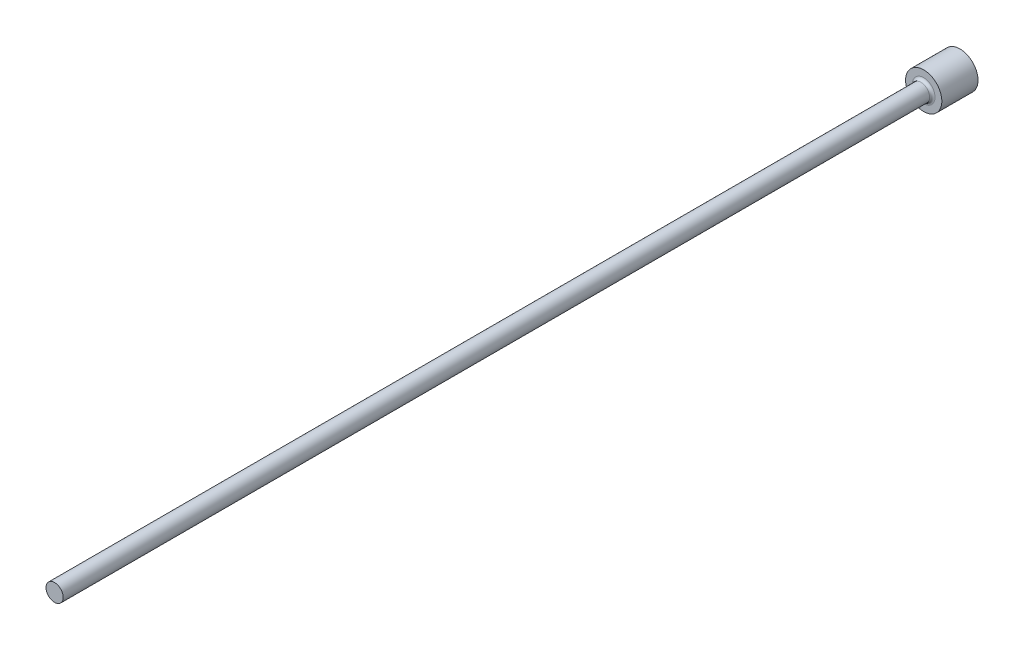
ISO-10303-21;
HEADER;
FILE_DESCRIPTION(('STEP AP214'),'2;1');
FILE_NAME('part.step','',(''),(''),'','','');
FILE_SCHEMA(('AUTOMOTIVE_DESIGN { 1 0 10303 214 1 1 1 1 }'));
ENDSEC;
DATA;
#1=APPLICATION_CONTEXT('core data for automotive mechanical design processes');
#2=APPLICATION_PROTOCOL_DEFINITION('international standard','automotive_design',2000,#1);
#3=PRODUCT_CONTEXT('',#1,'mechanical');
#4=PRODUCT('Part','Part','',(#3));
#5=PRODUCT_RELATED_PRODUCT_CATEGORY('part','',(#4));
#6=PRODUCT_DEFINITION_FORMATION('','',#4);
#7=PRODUCT_DEFINITION_CONTEXT('part definition',#1,'design');
#8=PRODUCT_DEFINITION('design','',#6,#7);
#9=PRODUCT_DEFINITION_SHAPE('','',#8);
#10=(LENGTH_UNIT() NAMED_UNIT(*) SI_UNIT(.MILLI.,.METRE.));
#11=(NAMED_UNIT(*) PLANE_ANGLE_UNIT() SI_UNIT($,.RADIAN.));
#12=(NAMED_UNIT(*) SI_UNIT($,.STERADIAN.) SOLID_ANGLE_UNIT());
#13=UNCERTAINTY_MEASURE_WITH_UNIT(LENGTH_MEASURE(1.E-05),#10,'distance_accuracy_value','');
#14=(GEOMETRIC_REPRESENTATION_CONTEXT(3) GLOBAL_UNCERTAINTY_ASSIGNED_CONTEXT((#13)) GLOBAL_UNIT_ASSIGNED_CONTEXT((#10,
#11,#12)) REPRESENTATION_CONTEXT('',''));
#15=CARTESIAN_POINT('',(0.,0.,0.));
#16=DIRECTION('',(0.,0.,1.));
#17=DIRECTION('',(1.,0.,0.));
#18=AXIS2_PLACEMENT_3D('',#15,#16,#17);
#19=CARTESIAN_POINT('',(2.,0.,4.));
#20=DIRECTION('',(0.,0.,-1.));
#21=DIRECTION('',(-1.,0.,0.));
#22=AXIS2_PLACEMENT_3D('',#19,#20,#21);
#23=PLANE('',#22);
#24=CARTESIAN_POINT('',(0.,0.,4.));
#25=DIRECTION('',(0.,0.,-1.));
#26=DIRECTION('',(-1.,0.,0.));
#27=AXIS2_PLACEMENT_3D('',#24,#25,#26);
#28=CIRCLE('',#27,1.25000000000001);
#29=CARTESIAN_POINT('',(-1.25000000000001,0.,4.));
#30=VERTEX_POINT('',#29);
#31=EDGE_CURVE('E40',#30,#30,#28,.T.);
#32=ORIENTED_EDGE('',*,*,#31,.T.);
#33=EDGE_LOOP('',(#32));
#34=FACE_BOUND('',#33,.T.);
#35=CARTESIAN_POINT('',(0.,0.,4.));
#36=DIRECTION('',(0.,0.,-1.));
#37=DIRECTION('',(-1.,0.,0.));
#38=AXIS2_PLACEMENT_3D('',#35,#36,#37);
#39=CIRCLE('',#38,2.);
#40=CARTESIAN_POINT('',(-2.,0.,4.));
#41=VERTEX_POINT('',#40);
#42=EDGE_CURVE('E44',#41,#41,#39,.T.);
#43=ORIENTED_EDGE('',*,*,#42,.F.);
#44=EDGE_LOOP('',(#43));
#45=FACE_BOUND('',#44,.T.);
#46=ADVANCED_FACE('F33',(#34,#45),#23,.F.);
#47=CARTESIAN_POINT('',(0.,0.,-9.03322817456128));
#48=DIRECTION('',(0.,0.,-1.));
#49=DIRECTION('',(-1.,0.,0.));
#50=AXIS2_PLACEMENT_3D('',#47,#48,#49);
#51=CYLINDRICAL_SURFACE('',#50,2.);
#52=CARTESIAN_POINT('',(0.,0.,0.));
#53=DIRECTION('',(0.,0.,-1.));
#54=DIRECTION('',(-1.,0.,0.));
#55=AXIS2_PLACEMENT_3D('',#52,#53,#54);
#56=CIRCLE('',#55,2.);
#57=CARTESIAN_POINT('',(-2.,0.,0.));
#58=VERTEX_POINT('',#57);
#59=EDGE_CURVE('E48',#58,#58,#56,.T.);
#60=ORIENTED_EDGE('',*,*,#59,.F.);
#61=EDGE_LOOP('',(#60));
#62=FACE_BOUND('',#61,.T.);
#63=ORIENTED_EDGE('',*,*,#42,.T.);
#64=EDGE_LOOP('',(#63));
#65=FACE_BOUND('',#64,.T.);
#66=ADVANCED_FACE('F68',(#62,#65),#51,.T.);
#67=CARTESIAN_POINT('',(0.,0.,0.));
#68=DIRECTION('',(0.,0.,1.));
#69=DIRECTION('',(1.,0.,0.));
#70=AXIS2_PLACEMENT_3D('',#67,#68,#69);
#71=PLANE('',#70);
#72=ORIENTED_EDGE('',*,*,#59,.T.);
#73=EDGE_LOOP('',(#72));
#74=FACE_BOUND('',#73,.T.);
#75=ADVANCED_FACE('F61',(#74),#71,.F.);
#76=CARTESIAN_POINT('',(0.,0.,100.));
#77=DIRECTION('',(0.,0.,-1.));
#78=DIRECTION('',(-1.,0.,0.));
#79=AXIS2_PLACEMENT_3D('',#76,#77,#78);
#80=PLANE('',#79);
#81=CARTESIAN_POINT('',(0.,0.,100.));
#82=DIRECTION('',(0.,0.,-1.));
#83=DIRECTION('',(-1.,0.,0.));
#84=AXIS2_PLACEMENT_3D('',#81,#82,#83);
#85=CIRCLE('',#84,0.950000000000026);
#86=CARTESIAN_POINT('',(-0.950000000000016,0.,100.));
#87=VERTEX_POINT('',#86);
#88=EDGE_CURVE('E53',#87,#87,#85,.T.);
#89=ORIENTED_EDGE('',*,*,#88,.F.);
#90=EDGE_LOOP('',(#89));
#91=FACE_BOUND('',#90,.T.);
#92=ADVANCED_FACE('F59',(#91),#80,.F.);
#93=CARTESIAN_POINT('',(0.,0.,-9.03322817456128));
#94=DIRECTION('',(0.,0.,-1.));
#95=DIRECTION('',(-1.,0.,0.));
#96=AXIS2_PLACEMENT_3D('',#93,#94,#95);
#97=CYLINDRICAL_SURFACE('',#96,0.950000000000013);
#98=CARTESIAN_POINT('',(0.,0.,4.3));
#99=DIRECTION('',(0.,0.,-1.));
#100=DIRECTION('',(-1.,0.,0.));
#101=AXIS2_PLACEMENT_3D('',#98,#99,#100);
#102=CIRCLE('',#101,0.950000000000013);
#103=CARTESIAN_POINT('',(-0.950000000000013,0.,4.3));
#104=VERTEX_POINT('',#103);
#105=EDGE_CURVE('E10',#104,#104,#102,.F.);
#106=ORIENTED_EDGE('',*,*,#105,.T.);
#107=EDGE_LOOP('',(#106));
#108=FACE_BOUND('',#107,.T.);
#109=ORIENTED_EDGE('',*,*,#88,.T.);
#110=EDGE_LOOP('',(#109));
#111=FACE_BOUND('',#110,.T.);
#112=ADVANCED_FACE('F57',(#108,#111),#97,.T.);
#113=CARTESIAN_POINT('',(0.,0.,4.3));
#114=DIRECTION('',(0.,0.,-1.));
#115=DIRECTION('',(-1.,0.,0.));
#116=AXIS2_PLACEMENT_3D('',#113,#114,#115);
#117=TOROIDAL_SURFACE('',#116,1.25000000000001,0.3);
#118=ORIENTED_EDGE('',*,*,#105,.F.);
#119=EDGE_LOOP('',(#118));
#120=FACE_BOUND('',#119,.T.);
#121=ORIENTED_EDGE('',*,*,#31,.F.);
#122=EDGE_LOOP('',(#121));
#123=FACE_BOUND('',#122,.T.);
#124=ADVANCED_FACE('F35',(#120,#123),#117,.F.);
#125=CLOSED_SHELL('',(#46,#66,#75,#92,#112,#124));
#126=MANIFOLD_SOLID_BREP('B2',#125);
#127=ADVANCED_BREP_SHAPE_REPRESENTATION('',(#18,#126),#14);
#128=SHAPE_DEFINITION_REPRESENTATION(#9,#127);
ENDSEC;
END-ISO-10303-21;
